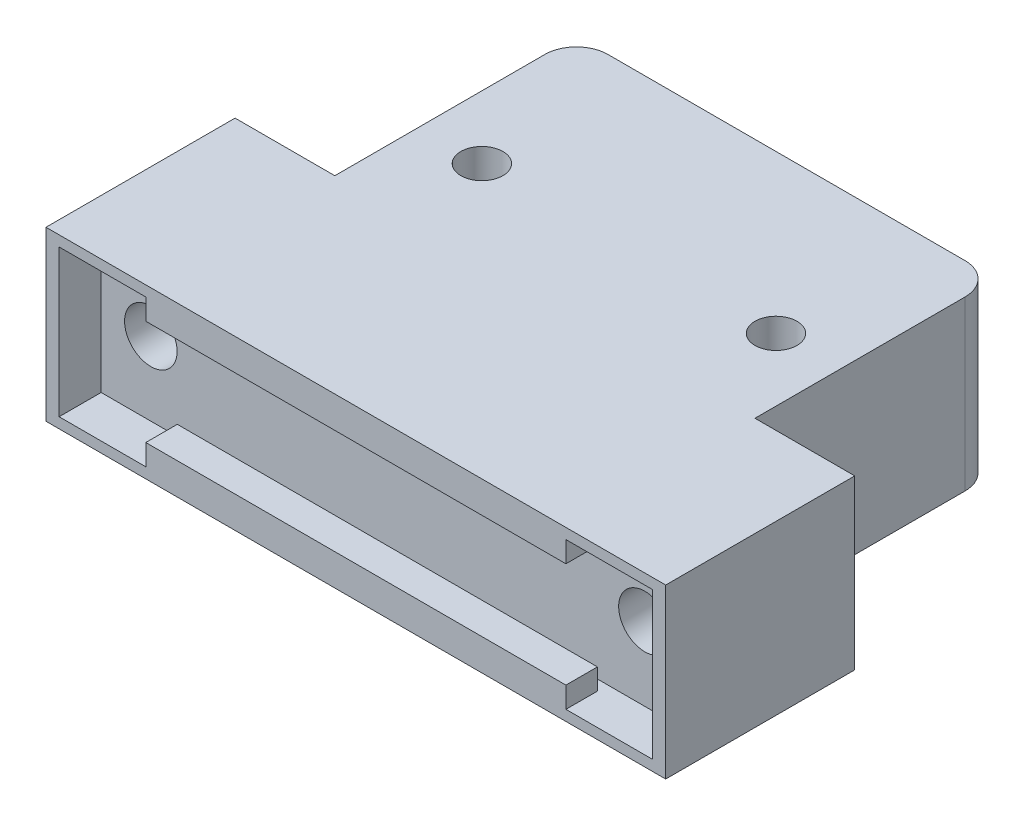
ISO-10303-21;
HEADER;
FILE_DESCRIPTION(('STEP AP214'),'2;1');
FILE_NAME('part.step','',(''),(''),'','','');
FILE_SCHEMA(('AUTOMOTIVE_DESIGN { 1 0 10303 214 1 1 1 1 }'));
ENDSEC;
DATA;
#1=APPLICATION_CONTEXT('core data for automotive mechanical design processes');
#2=APPLICATION_PROTOCOL_DEFINITION('international standard','automotive_design',2000,#1);
#3=PRODUCT_CONTEXT('',#1,'mechanical');
#4=PRODUCT('Part','Part','',(#3));
#5=PRODUCT_RELATED_PRODUCT_CATEGORY('part','',(#4));
#6=PRODUCT_DEFINITION_FORMATION('','',#4);
#7=PRODUCT_DEFINITION_CONTEXT('part definition',#1,'design');
#8=PRODUCT_DEFINITION('design','',#6,#7);
#9=PRODUCT_DEFINITION_SHAPE('','',#8);
#10=(LENGTH_UNIT() NAMED_UNIT(*) SI_UNIT(.MILLI.,.METRE.));
#11=(NAMED_UNIT(*) PLANE_ANGLE_UNIT() SI_UNIT($,.RADIAN.));
#12=(NAMED_UNIT(*) SI_UNIT($,.STERADIAN.) SOLID_ANGLE_UNIT());
#13=UNCERTAINTY_MEASURE_WITH_UNIT(LENGTH_MEASURE(1.E-05),#10,'distance_accuracy_value','');
#14=(GEOMETRIC_REPRESENTATION_CONTEXT(3) GLOBAL_UNCERTAINTY_ASSIGNED_CONTEXT((#13)) GLOBAL_UNIT_ASSIGNED_CONTEXT((#10,
#11,#12)) REPRESENTATION_CONTEXT('',''));
#15=CARTESIAN_POINT('',(0.,0.,0.));
#16=DIRECTION('',(0.,0.,1.));
#17=DIRECTION('',(1.,0.,0.));
#18=AXIS2_PLACEMENT_3D('',#15,#16,#17);
#19=CARTESIAN_POINT('',(-28.25,-7.,14.));
#20=DIRECTION('',(0.,-1.,0.));
#21=DIRECTION('',(0.,0.,-1.));
#22=AXIS2_PLACEMENT_3D('',#19,#20,#21);
#23=PLANE('',#22);
#24=DIRECTION('',(0.,0.,-1.));
#25=VECTOR('',#24,1.);
#26=CARTESIAN_POINT('',(20.,-7.,18.));
#27=LINE('',#26,#25);
#28=CARTESIAN_POINT('',(20.,-7.,18.));
#29=VERTEX_POINT('',#28);
#30=CARTESIAN_POINT('',(20.,-7.,15.));
#31=VERTEX_POINT('',#30);
#32=EDGE_CURVE('E196',#29,#31,#27,.T.);
#33=ORIENTED_EDGE('',*,*,#32,.F.);
#34=DIRECTION('',(1.,0.,0.));
#35=VECTOR('',#34,1.);
#36=CARTESIAN_POINT('',(-28.25,-7.,18.));
#37=LINE('',#36,#35);
#38=CARTESIAN_POINT('',(28.25,-7.,18.));
#39=VERTEX_POINT('',#38);
#40=EDGE_CURVE('E294',#29,#39,#37,.T.);
#41=ORIENTED_EDGE('',*,*,#40,.T.);
#42=DIRECTION('',(0.,0.,1.));
#43=VECTOR('',#42,1.);
#44=CARTESIAN_POINT('',(28.25,-7.,14.));
#45=LINE('',#44,#43);
#46=CARTESIAN_POINT('',(28.25,-7.,14.));
#47=VERTEX_POINT('',#46);
#48=EDGE_CURVE('E296',#47,#39,#45,.T.);
#49=ORIENTED_EDGE('',*,*,#48,.F.);
#50=DIRECTION('',(1.,0.,0.));
#51=VECTOR('',#50,1.);
#52=CARTESIAN_POINT('',(-28.25,-7.,14.));
#53=LINE('',#52,#51);
#54=CARTESIAN_POINT('',(-28.25,-7.,14.));
#55=VERTEX_POINT('',#54);
#56=EDGE_CURVE('E283',#55,#47,#53,.T.);
#57=ORIENTED_EDGE('',*,*,#56,.F.);
#58=DIRECTION('',(0.,0.,1.));
#59=VECTOR('',#58,1.);
#60=CARTESIAN_POINT('',(-28.25,-7.,14.));
#61=LINE('',#60,#59);
#62=CARTESIAN_POINT('',(-28.25,-7.,18.));
#63=VERTEX_POINT('',#62);
#64=EDGE_CURVE('E300',#55,#63,#61,.T.);
#65=ORIENTED_EDGE('',*,*,#64,.T.);
#66=CARTESIAN_POINT('',(-20.,-7.,18.));
#67=VERTEX_POINT('',#66);
#68=EDGE_CURVE('E277',#63,#67,#37,.T.);
#69=ORIENTED_EDGE('',*,*,#68,.T.);
#70=DIRECTION('',(0.,0.,1.));
#71=VECTOR('',#70,1.);
#72=CARTESIAN_POINT('',(-20.,-7.,18.));
#73=LINE('',#72,#71);
#74=CARTESIAN_POINT('',(-20.,-7.,15.));
#75=VERTEX_POINT('',#74);
#76=EDGE_CURVE('E235',#75,#67,#73,.T.);
#77=ORIENTED_EDGE('',*,*,#76,.F.);
#78=DIRECTION('',(-1.,0.,0.));
#79=VECTOR('',#78,1.);
#80=CARTESIAN_POINT('',(20.,-7.,15.));
#81=LINE('',#80,#79);
#82=EDGE_CURVE('E244',#31,#75,#81,.T.);
#83=ORIENTED_EDGE('',*,*,#82,.F.);
#84=EDGE_LOOP('',(#33,#41,#49,#57,#65,#69,#77,#83));
#85=FACE_BOUND('',#84,.T.);
#86=ADVANCED_FACE('F33',(#85),#23,.F.);
#87=CARTESIAN_POINT('',(-20.,8.,-23.));
#88=DIRECTION('',(1.,0.,0.));
#89=DIRECTION('',(0.,0.,-1.));
#90=AXIS2_PLACEMENT_3D('',#87,#88,#89);
#91=PLANE('',#90);
#92=DIRECTION('',(0.,0.,1.));
#93=VECTOR('',#92,1.);
#94=CARTESIAN_POINT('',(-20.,8.,-23.));
#95=LINE('',#94,#93);
#96=CARTESIAN_POINT('',(-20.,8.,-20.));
#97=VERTEX_POINT('',#96);
#98=CARTESIAN_POINT('',(-20.,8.,0.));
#99=VERTEX_POINT('',#98);
#100=EDGE_CURVE('E307',#97,#99,#95,.T.);
#101=ORIENTED_EDGE('',*,*,#100,.F.);
#102=DIRECTION('',(0.,-1.,0.));
#103=VECTOR('',#102,1.);
#104=CARTESIAN_POINT('',(-20.,8.,-20.));
#105=LINE('',#104,#103);
#106=CARTESIAN_POINT('',(-20.,-8.,-20.));
#107=VERTEX_POINT('',#106);
#108=EDGE_CURVE('E11',#97,#107,#105,.T.);
#109=ORIENTED_EDGE('',*,*,#108,.T.);
#110=DIRECTION('',(0.,0.,1.));
#111=VECTOR('',#110,1.);
#112=CARTESIAN_POINT('',(-20.,-8.,-23.));
#113=LINE('',#112,#111);
#114=CARTESIAN_POINT('',(-20.,-8.,0.));
#115=VERTEX_POINT('',#114);
#116=EDGE_CURVE('E299',#107,#115,#113,.T.);
#117=ORIENTED_EDGE('',*,*,#116,.T.);
#118=DIRECTION('',(0.,-1.,0.));
#119=VECTOR('',#118,1.);
#120=CARTESIAN_POINT('',(-20.,8.,0.));
#121=LINE('',#120,#119);
#122=EDGE_CURVE('E354',#99,#115,#121,.T.);
#123=ORIENTED_EDGE('',*,*,#122,.F.);
#124=EDGE_LOOP('',(#101,#109,#117,#123));
#125=FACE_BOUND('',#124,.T.);
#126=ADVANCED_FACE('F407',(#125),#91,.F.);
#127=CARTESIAN_POINT('',(-20.,8.,0.));
#128=DIRECTION('',(0.,0.,1.));
#129=DIRECTION('',(1.,0.,0.));
#130=AXIS2_PLACEMENT_3D('',#127,#128,#129);
#131=PLANE('',#130);
#132=CARTESIAN_POINT('',(-23.52,0.,0.));
#133=DIRECTION('',(0.,0.,1.));
#134=DIRECTION('',(1.,0.,0.));
#135=AXIS2_PLACEMENT_3D('',#132,#133,#134);
#136=CIRCLE('',#135,2.5);
#137=CARTESIAN_POINT('',(-21.02,0.,0.));
#138=VERTEX_POINT('',#137);
#139=EDGE_CURVE('E269',#138,#138,#136,.T.);
#140=ORIENTED_EDGE('',*,*,#139,.T.);
#141=EDGE_LOOP('',(#140));
#142=FACE_BOUND('',#141,.T.);
#143=DIRECTION('',(-1.,0.,0.));
#144=VECTOR('',#143,1.);
#145=CARTESIAN_POINT('',(-20.,-8.,0.));
#146=LINE('',#145,#144);
#147=CARTESIAN_POINT('',(-29.5,-8.,0.));
#148=VERTEX_POINT('',#147);
#149=EDGE_CURVE('E326',#115,#148,#146,.T.);
#150=ORIENTED_EDGE('',*,*,#149,.T.);
#151=DIRECTION('',(0.,-1.,0.));
#152=VECTOR('',#151,1.);
#153=CARTESIAN_POINT('',(-29.5,8.,0.));
#154=LINE('',#153,#152);
#155=CARTESIAN_POINT('',(-29.5,8.,0.));
#156=VERTEX_POINT('',#155);
#157=EDGE_CURVE('E351',#156,#148,#154,.T.);
#158=ORIENTED_EDGE('',*,*,#157,.F.);
#159=DIRECTION('',(-1.,0.,0.));
#160=VECTOR('',#159,1.);
#161=CARTESIAN_POINT('',(-20.,8.,0.));
#162=LINE('',#161,#160);
#163=EDGE_CURVE('E309',#99,#156,#162,.T.);
#164=ORIENTED_EDGE('',*,*,#163,.F.);
#165=ORIENTED_EDGE('',*,*,#122,.T.);
#166=EDGE_LOOP('',(#150,#158,#164,#165));
#167=FACE_BOUND('',#166,.T.);
#168=ADVANCED_FACE('F405',(#142,#167),#131,.F.);
#169=CARTESIAN_POINT('',(-29.5,8.,0.));
#170=DIRECTION('',(1.,0.,0.));
#171=DIRECTION('',(0.,0.,-1.));
#172=AXIS2_PLACEMENT_3D('',#169,#170,#171);
#173=PLANE('',#172);
#174=DIRECTION('',(0.,0.,1.));
#175=VECTOR('',#174,1.);
#176=CARTESIAN_POINT('',(-29.5,-8.,0.));
#177=LINE('',#176,#175);
#178=CARTESIAN_POINT('',(-29.5,-8.,18.));
#179=VERTEX_POINT('',#178);
#180=EDGE_CURVE('E328',#148,#179,#177,.T.);
#181=ORIENTED_EDGE('',*,*,#180,.T.);
#182=DIRECTION('',(0.,-1.,0.));
#183=VECTOR('',#182,1.);
#184=CARTESIAN_POINT('',(-29.5,8.,18.));
#185=LINE('',#184,#183);
#186=CARTESIAN_POINT('',(-29.5,8.,18.));
#187=VERTEX_POINT('',#186);
#188=EDGE_CURVE('E348',#187,#179,#185,.T.);
#189=ORIENTED_EDGE('',*,*,#188,.F.);
#190=DIRECTION('',(0.,0.,1.));
#191=VECTOR('',#190,1.);
#192=CARTESIAN_POINT('',(-29.5,8.,0.));
#193=LINE('',#192,#191);
#194=EDGE_CURVE('E312',#156,#187,#193,.T.);
#195=ORIENTED_EDGE('',*,*,#194,.F.);
#196=ORIENTED_EDGE('',*,*,#157,.T.);
#197=EDGE_LOOP('',(#181,#189,#195,#196));
#198=FACE_BOUND('',#197,.T.);
#199=ADVANCED_FACE('F398',(#198),#173,.F.);
#200=CARTESIAN_POINT('',(-29.5,8.,18.));
#201=DIRECTION('',(0.,0.,-1.));
#202=DIRECTION('',(-1.,0.,0.));
#203=AXIS2_PLACEMENT_3D('',#200,#201,#202);
#204=PLANE('',#203);
#205=DIRECTION('',(-1.,0.,0.));
#206=VECTOR('',#205,1.);
#207=CARTESIAN_POINT('',(-28.25,7.,18.));
#208=LINE('',#207,#206);
#209=CARTESIAN_POINT('',(28.25,7.,18.));
#210=VERTEX_POINT('',#209);
#211=CARTESIAN_POINT('',(20.,7.,18.));
#212=VERTEX_POINT('',#211);
#213=EDGE_CURVE('E289',#210,#212,#208,.T.);
#214=ORIENTED_EDGE('',*,*,#213,.F.);
#215=DIRECTION('',(0.,1.,0.));
#216=VECTOR('',#215,1.);
#217=CARTESIAN_POINT('',(28.25,7.,18.));
#218=LINE('',#217,#216);
#219=EDGE_CURVE('E272',#39,#210,#218,.T.);
#220=ORIENTED_EDGE('',*,*,#219,.F.);
#221=ORIENTED_EDGE('',*,*,#40,.F.);
#222=DIRECTION('',(0.,-1.,0.));
#223=VECTOR('',#222,1.);
#224=CARTESIAN_POINT('',(20.,-5.,18.));
#225=LINE('',#224,#223);
#226=CARTESIAN_POINT('',(20.,-5.,18.));
#227=VERTEX_POINT('',#226);
#228=EDGE_CURVE('E241',#227,#29,#225,.T.);
#229=ORIENTED_EDGE('',*,*,#228,.F.);
#230=DIRECTION('',(1.,0.,0.));
#231=VECTOR('',#230,1.);
#232=CARTESIAN_POINT('',(20.,-5.,18.));
#233=LINE('',#232,#231);
#234=CARTESIAN_POINT('',(-20.,-5.,18.));
#235=VERTEX_POINT('',#234);
#236=EDGE_CURVE('E239',#235,#227,#233,.T.);
#237=ORIENTED_EDGE('',*,*,#236,.F.);
#238=DIRECTION('',(0.,-1.,0.));
#239=VECTOR('',#238,1.);
#240=CARTESIAN_POINT('',(-20.,-5.,18.));
#241=LINE('',#240,#239);
#242=EDGE_CURVE('E251',#235,#67,#241,.T.);
#243=ORIENTED_EDGE('',*,*,#242,.T.);
#244=ORIENTED_EDGE('',*,*,#68,.F.);
#245=DIRECTION('',(0.,-1.,0.));
#246=VECTOR('',#245,1.);
#247=CARTESIAN_POINT('',(-28.25,7.,18.));
#248=LINE('',#247,#246);
#249=CARTESIAN_POINT('',(-28.25,7.,18.));
#250=VERTEX_POINT('',#249);
#251=EDGE_CURVE('E291',#250,#63,#248,.T.);
#252=ORIENTED_EDGE('',*,*,#251,.F.);
#253=CARTESIAN_POINT('',(-20.,7.,18.));
#254=VERTEX_POINT('',#253);
#255=EDGE_CURVE('E288',#254,#250,#208,.T.);
#256=ORIENTED_EDGE('',*,*,#255,.F.);
#257=DIRECTION('',(0.,1.,0.));
#258=VECTOR('',#257,1.);
#259=CARTESIAN_POINT('',(-20.,5.,18.));
#260=LINE('',#259,#258);
#261=CARTESIAN_POINT('',(-20.,5.,18.));
#262=VERTEX_POINT('',#261);
#263=EDGE_CURVE('E197',#262,#254,#260,.T.);
#264=ORIENTED_EDGE('',*,*,#263,.F.);
#265=DIRECTION('',(1.,0.,0.));
#266=VECTOR('',#265,1.);
#267=CARTESIAN_POINT('',(20.,5.,18.));
#268=LINE('',#267,#266);
#269=CARTESIAN_POINT('',(20.,5.,18.));
#270=VERTEX_POINT('',#269);
#271=EDGE_CURVE('E203',#262,#270,#268,.T.);
#272=ORIENTED_EDGE('',*,*,#271,.T.);
#273=DIRECTION('',(0.,1.,0.));
#274=VECTOR('',#273,1.);
#275=CARTESIAN_POINT('',(20.,5.,18.));
#276=LINE('',#275,#274);
#277=EDGE_CURVE('E185',#270,#212,#276,.T.);
#278=ORIENTED_EDGE('',*,*,#277,.T.);
#279=EDGE_LOOP('',(#214,#220,#221,#229,#237,#243,#244,#252,#256,#264,#272,#278));
#280=FACE_BOUND('',#279,.T.);
#281=DIRECTION('',(1.,0.,0.));
#282=VECTOR('',#281,1.);
#283=CARTESIAN_POINT('',(-29.5,-8.,18.));
#284=LINE('',#283,#282);
#285=CARTESIAN_POINT('',(29.5,-8.,18.));
#286=VERTEX_POINT('',#285);
#287=EDGE_CURVE('E330',#179,#286,#284,.T.);
#288=ORIENTED_EDGE('',*,*,#287,.T.);
#289=DIRECTION('',(0.,-1.,0.));
#290=VECTOR('',#289,1.);
#291=CARTESIAN_POINT('',(29.5,8.,18.));
#292=LINE('',#291,#290);
#293=CARTESIAN_POINT('',(29.5,8.,18.));
#294=VERTEX_POINT('',#293);
#295=EDGE_CURVE('E345',#294,#286,#292,.T.);
#296=ORIENTED_EDGE('',*,*,#295,.F.);
#297=DIRECTION('',(1.,0.,0.));
#298=VECTOR('',#297,1.);
#299=CARTESIAN_POINT('',(-29.5,8.,18.));
#300=LINE('',#299,#298);
#301=EDGE_CURVE('E314',#187,#294,#300,.T.);
#302=ORIENTED_EDGE('',*,*,#301,.F.);
#303=ORIENTED_EDGE('',*,*,#188,.T.);
#304=EDGE_LOOP('',(#288,#296,#302,#303));
#305=FACE_BOUND('',#304,.T.);
#306=ADVANCED_FACE('F209',(#280,#305),#204,.F.);
#307=CARTESIAN_POINT('',(29.5,8.,0.));
#308=DIRECTION('',(-1.,0.,0.));
#309=DIRECTION('',(0.,0.,1.));
#310=AXIS2_PLACEMENT_3D('',#307,#308,#309);
#311=PLANE('',#310);
#312=DIRECTION('',(0.,0.,-1.));
#313=VECTOR('',#312,1.);
#314=CARTESIAN_POINT('',(29.5,-8.,0.));
#315=LINE('',#314,#313);
#316=CARTESIAN_POINT('',(29.5,-8.,0.));
#317=VERTEX_POINT('',#316);
#318=EDGE_CURVE('E332',#286,#317,#315,.T.);
#319=ORIENTED_EDGE('',*,*,#318,.T.);
#320=DIRECTION('',(0.,-1.,0.));
#321=VECTOR('',#320,1.);
#322=CARTESIAN_POINT('',(29.5,8.,0.));
#323=LINE('',#322,#321);
#324=CARTESIAN_POINT('',(29.5,8.,0.));
#325=VERTEX_POINT('',#324);
#326=EDGE_CURVE('E342',#325,#317,#323,.T.);
#327=ORIENTED_EDGE('',*,*,#326,.F.);
#328=DIRECTION('',(0.,0.,-1.));
#329=VECTOR('',#328,1.);
#330=CARTESIAN_POINT('',(29.5,8.,0.));
#331=LINE('',#330,#329);
#332=EDGE_CURVE('E316',#294,#325,#331,.T.);
#333=ORIENTED_EDGE('',*,*,#332,.F.);
#334=ORIENTED_EDGE('',*,*,#295,.T.);
#335=EDGE_LOOP('',(#319,#327,#333,#334));
#336=FACE_BOUND('',#335,.T.);
#337=ADVANCED_FACE('F391',(#336),#311,.F.);
#338=CARTESIAN_POINT('',(20.,8.,0.));
#339=DIRECTION('',(0.,0.,1.));
#340=DIRECTION('',(1.,0.,0.));
#341=AXIS2_PLACEMENT_3D('',#338,#339,#340);
#342=PLANE('',#341);
#343=CARTESIAN_POINT('',(23.52,0.,0.));
#344=DIRECTION('',(0.,0.,1.));
#345=DIRECTION('',(1.,0.,0.));
#346=AXIS2_PLACEMENT_3D('',#343,#344,#345);
#347=CIRCLE('',#346,2.5);
#348=CARTESIAN_POINT('',(26.02,0.,0.));
#349=VERTEX_POINT('',#348);
#350=EDGE_CURVE('E263',#349,#349,#347,.F.);
#351=ORIENTED_EDGE('',*,*,#350,.F.);
#352=EDGE_LOOP('',(#351));
#353=FACE_BOUND('',#352,.T.);
#354=DIRECTION('',(-1.,0.,0.));
#355=VECTOR('',#354,1.);
#356=CARTESIAN_POINT('',(20.,-8.,0.));
#357=LINE('',#356,#355);
#358=CARTESIAN_POINT('',(20.,-8.,0.));
#359=VERTEX_POINT('',#358);
#360=EDGE_CURVE('E334',#317,#359,#357,.T.);
#361=ORIENTED_EDGE('',*,*,#360,.T.);
#362=DIRECTION('',(0.,-1.,0.));
#363=VECTOR('',#362,1.);
#364=CARTESIAN_POINT('',(20.,8.,0.));
#365=LINE('',#364,#363);
#366=CARTESIAN_POINT('',(20.,8.,0.));
#367=VERTEX_POINT('',#366);
#368=EDGE_CURVE('E324',#367,#359,#365,.T.);
#369=ORIENTED_EDGE('',*,*,#368,.F.);
#370=DIRECTION('',(-1.,0.,0.));
#371=VECTOR('',#370,1.);
#372=CARTESIAN_POINT('',(20.,8.,0.));
#373=LINE('',#372,#371);
#374=EDGE_CURVE('E318',#325,#367,#373,.T.);
#375=ORIENTED_EDGE('',*,*,#374,.F.);
#376=ORIENTED_EDGE('',*,*,#326,.T.);
#377=EDGE_LOOP('',(#361,#369,#375,#376));
#378=FACE_BOUND('',#377,.T.);
#379=ADVANCED_FACE('F385',(#353,#378),#342,.F.);
#380=CARTESIAN_POINT('',(20.,8.,-23.));
#381=DIRECTION('',(-1.,0.,0.));
#382=DIRECTION('',(0.,0.,1.));
#383=AXIS2_PLACEMENT_3D('',#380,#381,#382);
#384=PLANE('',#383);
#385=DIRECTION('',(0.,0.,-1.));
#386=VECTOR('',#385,1.);
#387=CARTESIAN_POINT('',(20.,-8.,-23.));
#388=LINE('',#387,#386);
#389=CARTESIAN_POINT('',(20.,-8.,-20.));
#390=VERTEX_POINT('',#389);
#391=EDGE_CURVE('E336',#359,#390,#388,.T.);
#392=ORIENTED_EDGE('',*,*,#391,.T.);
#393=DIRECTION('',(0.,-1.,0.));
#394=VECTOR('',#393,1.);
#395=CARTESIAN_POINT('',(20.,8.,-20.));
#396=LINE('',#395,#394);
#397=CARTESIAN_POINT('',(20.,8.,-20.));
#398=VERTEX_POINT('',#397);
#399=EDGE_CURVE('E56',#390,#398,#396,.F.);
#400=ORIENTED_EDGE('',*,*,#399,.T.);
#401=DIRECTION('',(0.,0.,-1.));
#402=VECTOR('',#401,1.);
#403=CARTESIAN_POINT('',(20.,8.,-23.));
#404=LINE('',#403,#402);
#405=EDGE_CURVE('E320',#367,#398,#404,.T.);
#406=ORIENTED_EDGE('',*,*,#405,.F.);
#407=ORIENTED_EDGE('',*,*,#368,.T.);
#408=EDGE_LOOP('',(#392,#400,#406,#407));
#409=FACE_BOUND('',#408,.T.);
#410=ADVANCED_FACE('F381',(#409),#384,.F.);
#411=CARTESIAN_POINT('',(20.,8.,-23.));
#412=DIRECTION('',(0.,0.,1.));
#413=DIRECTION('',(1.,0.,0.));
#414=AXIS2_PLACEMENT_3D('',#411,#412,#413);
#415=PLANE('',#414);
#416=DIRECTION('',(-1.,0.,0.));
#417=VECTOR('',#416,1.);
#418=CARTESIAN_POINT('',(20.,8.,-23.));
#419=LINE('',#418,#417);
#420=CARTESIAN_POINT('',(17.,8.,-23.));
#421=VERTEX_POINT('',#420);
#422=CARTESIAN_POINT('',(-17.,8.,-23.));
#423=VERTEX_POINT('',#422);
#424=EDGE_CURVE('E322',#421,#423,#419,.T.);
#425=ORIENTED_EDGE('',*,*,#424,.F.);
#426=DIRECTION('',(0.,-1.,0.));
#427=VECTOR('',#426,1.);
#428=CARTESIAN_POINT('',(17.,8.,-23.));
#429=LINE('',#428,#427);
#430=CARTESIAN_POINT('',(17.,-8.,-23.));
#431=VERTEX_POINT('',#430);
#432=EDGE_CURVE('E359',#421,#431,#429,.T.);
#433=ORIENTED_EDGE('',*,*,#432,.T.);
#434=DIRECTION('',(-1.,0.,0.));
#435=VECTOR('',#434,1.);
#436=CARTESIAN_POINT('',(20.,-8.,-23.));
#437=LINE('',#436,#435);
#438=CARTESIAN_POINT('',(-17.,-8.,-23.));
#439=VERTEX_POINT('',#438);
#440=EDGE_CURVE('E310',#431,#439,#437,.T.);
#441=ORIENTED_EDGE('',*,*,#440,.T.);
#442=DIRECTION('',(0.,-1.,0.));
#443=VECTOR('',#442,1.);
#444=CARTESIAN_POINT('',(-17.,8.,-23.));
#445=LINE('',#444,#443);
#446=EDGE_CURVE('E357',#439,#423,#445,.F.);
#447=ORIENTED_EDGE('',*,*,#446,.T.);
#448=EDGE_LOOP('',(#425,#433,#441,#447));
#449=FACE_BOUND('',#448,.T.);
#450=ADVANCED_FACE('F373',(#449),#415,.F.);
#451=CARTESIAN_POINT('',(0.,8.,0.));
#452=DIRECTION('',(0.,-1.,0.));
#453=DIRECTION('',(0.,0.,-1.));
#454=AXIS2_PLACEMENT_3D('',#451,#452,#453);
#455=PLANE('',#454);
#456=CARTESIAN_POINT('',(14.,8.,-8.));
#457=DIRECTION('',(0.,-1.,0.));
#458=DIRECTION('',(0.,0.,1.));
#459=AXIS2_PLACEMENT_3D('',#456,#457,#458);
#460=CIRCLE('',#459,2.);
#461=CARTESIAN_POINT('',(14.,8.,-6.));
#462=VERTEX_POINT('',#461);
#463=EDGE_CURVE('E521',#462,#462,#460,.T.);
#464=ORIENTED_EDGE('',*,*,#463,.T.);
#465=EDGE_LOOP('',(#464));
#466=FACE_BOUND('',#465,.T.);
#467=CARTESIAN_POINT('',(-14.,8.,-8.));
#468=DIRECTION('',(0.,1.,0.));
#469=DIRECTION('',(0.,0.,1.));
#470=AXIS2_PLACEMENT_3D('',#467,#468,#469);
#471=CIRCLE('',#470,2.);
#472=CARTESIAN_POINT('',(-14.,8.,-6.));
#473=VERTEX_POINT('',#472);
#474=EDGE_CURVE('E523',#473,#473,#471,.T.);
#475=ORIENTED_EDGE('',*,*,#474,.F.);
#476=EDGE_LOOP('',(#475));
#477=FACE_BOUND('',#476,.T.);
#478=ORIENTED_EDGE('',*,*,#405,.T.);
#479=CARTESIAN_POINT('',(17.,8.,-20.));
#480=DIRECTION('',(0.,-1.,0.));
#481=DIRECTION('',(0.,0.,-1.));
#482=AXIS2_PLACEMENT_3D('',#479,#480,#481);
#483=CIRCLE('',#482,3.);
#484=EDGE_CURVE('E41',#398,#421,#483,.F.);
#485=ORIENTED_EDGE('',*,*,#484,.T.);
#486=ORIENTED_EDGE('',*,*,#424,.T.);
#487=CARTESIAN_POINT('',(-17.,8.,-20.));
#488=DIRECTION('',(0.,-1.,0.));
#489=DIRECTION('',(0.,0.,-1.));
#490=AXIS2_PLACEMENT_3D('',#487,#488,#489);
#491=CIRCLE('',#490,3.);
#492=EDGE_CURVE('E48',#423,#97,#491,.F.);
#493=ORIENTED_EDGE('',*,*,#492,.T.);
#494=ORIENTED_EDGE('',*,*,#100,.T.);
#495=ORIENTED_EDGE('',*,*,#163,.T.);
#496=ORIENTED_EDGE('',*,*,#194,.T.);
#497=ORIENTED_EDGE('',*,*,#301,.T.);
#498=ORIENTED_EDGE('',*,*,#332,.T.);
#499=ORIENTED_EDGE('',*,*,#374,.T.);
#500=EDGE_LOOP('',(#478,#485,#486,#493,#494,#495,#496,#497,#498,#499));
#501=FACE_BOUND('',#500,.T.);
#502=ADVANCED_FACE('F369',(#466,#477,#501),#455,.F.);
#503=CARTESIAN_POINT('',(0.,-8.,0.));
#504=DIRECTION('',(0.,-1.,0.));
#505=DIRECTION('',(0.,0.,-1.));
#506=AXIS2_PLACEMENT_3D('',#503,#504,#505);
#507=PLANE('',#506);
#508=CARTESIAN_POINT('',(14.,-8.,-8.));
#509=DIRECTION('',(0.,-1.,0.));
#510=DIRECTION('',(0.,0.,1.));
#511=AXIS2_PLACEMENT_3D('',#508,#509,#510);
#512=CIRCLE('',#511,2.);
#513=CARTESIAN_POINT('',(14.,-8.,-6.));
#514=VERTEX_POINT('',#513);
#515=EDGE_CURVE('E518',#514,#514,#512,.T.);
#516=ORIENTED_EDGE('',*,*,#515,.F.);
#517=EDGE_LOOP('',(#516));
#518=FACE_BOUND('',#517,.T.);
#519=CARTESIAN_POINT('',(-14.,-8.,-8.));
#520=DIRECTION('',(0.,1.,0.));
#521=DIRECTION('',(0.,0.,1.));
#522=AXIS2_PLACEMENT_3D('',#519,#520,#521);
#523=CIRCLE('',#522,2.);
#524=CARTESIAN_POINT('',(-14.,-8.,-6.));
#525=VERTEX_POINT('',#524);
#526=EDGE_CURVE('E221',#525,#525,#523,.T.);
#527=ORIENTED_EDGE('',*,*,#526,.T.);
#528=EDGE_LOOP('',(#527));
#529=FACE_BOUND('',#528,.T.);
#530=ORIENTED_EDGE('',*,*,#440,.F.);
#531=CARTESIAN_POINT('',(17.,-8.,-20.));
#532=DIRECTION('',(0.,-1.,0.));
#533=DIRECTION('',(0.,0.,-1.));
#534=AXIS2_PLACEMENT_3D('',#531,#532,#533);
#535=CIRCLE('',#534,3.);
#536=EDGE_CURVE('E364',#431,#390,#535,.T.);
#537=ORIENTED_EDGE('',*,*,#536,.T.);
#538=ORIENTED_EDGE('',*,*,#391,.F.);
#539=ORIENTED_EDGE('',*,*,#360,.F.);
#540=ORIENTED_EDGE('',*,*,#318,.F.);
#541=ORIENTED_EDGE('',*,*,#287,.F.);
#542=ORIENTED_EDGE('',*,*,#180,.F.);
#543=ORIENTED_EDGE('',*,*,#149,.F.);
#544=ORIENTED_EDGE('',*,*,#116,.F.);
#545=CARTESIAN_POINT('',(-17.,-8.,-20.));
#546=DIRECTION('',(0.,-1.,0.));
#547=DIRECTION('',(0.,0.,-1.));
#548=AXIS2_PLACEMENT_3D('',#545,#546,#547);
#549=CIRCLE('',#548,3.);
#550=EDGE_CURVE('E362',#107,#439,#549,.T.);
#551=ORIENTED_EDGE('',*,*,#550,.T.);
#552=EDGE_LOOP('',(#530,#537,#538,#539,#540,#541,#542,#543,#544,#551));
#553=FACE_BOUND('',#552,.T.);
#554=ADVANCED_FACE('F379',(#518,#529,#553),#507,.T.);
#555=CARTESIAN_POINT('',(28.25,7.,14.));
#556=DIRECTION('',(1.,0.,0.));
#557=DIRECTION('',(0.,0.,-1.));
#558=AXIS2_PLACEMENT_3D('',#555,#556,#557);
#559=PLANE('',#558);
#560=ORIENTED_EDGE('',*,*,#219,.T.);
#561=DIRECTION('',(0.,0.,1.));
#562=VECTOR('',#561,1.);
#563=CARTESIAN_POINT('',(28.25,7.,14.));
#564=LINE('',#563,#562);
#565=CARTESIAN_POINT('',(28.25,7.,14.));
#566=VERTEX_POINT('',#565);
#567=EDGE_CURVE('E286',#566,#210,#564,.T.);
#568=ORIENTED_EDGE('',*,*,#567,.F.);
#569=DIRECTION('',(0.,1.,0.));
#570=VECTOR('',#569,1.);
#571=CARTESIAN_POINT('',(28.25,7.,14.));
#572=LINE('',#571,#570);
#573=EDGE_CURVE('E273',#47,#566,#572,.T.);
#574=ORIENTED_EDGE('',*,*,#573,.F.);
#575=ORIENTED_EDGE('',*,*,#48,.T.);
#576=EDGE_LOOP('',(#560,#568,#574,#575));
#577=FACE_BOUND('',#576,.T.);
#578=ADVANCED_FACE('F437',(#577),#559,.F.);
#579=CARTESIAN_POINT('',(-28.25,7.,14.));
#580=DIRECTION('',(-1.,0.,0.));
#581=DIRECTION('',(0.,0.,1.));
#582=AXIS2_PLACEMENT_3D('',#579,#580,#581);
#583=PLANE('',#582);
#584=ORIENTED_EDGE('',*,*,#251,.T.);
#585=ORIENTED_EDGE('',*,*,#64,.F.);
#586=DIRECTION('',(0.,-1.,0.));
#587=VECTOR('',#586,1.);
#588=CARTESIAN_POINT('',(-28.25,7.,14.));
#589=LINE('',#588,#587);
#590=CARTESIAN_POINT('',(-28.25,7.,14.));
#591=VERTEX_POINT('',#590);
#592=EDGE_CURVE('E280',#591,#55,#589,.T.);
#593=ORIENTED_EDGE('',*,*,#592,.F.);
#594=DIRECTION('',(0.,0.,1.));
#595=VECTOR('',#594,1.);
#596=CARTESIAN_POINT('',(-28.25,7.,14.));
#597=LINE('',#596,#595);
#598=EDGE_CURVE('E302',#591,#250,#597,.T.);
#599=ORIENTED_EDGE('',*,*,#598,.T.);
#600=EDGE_LOOP('',(#584,#585,#593,#599));
#601=FACE_BOUND('',#600,.T.);
#602=ADVANCED_FACE('F433',(#601),#583,.F.);
#603=CARTESIAN_POINT('',(-28.25,7.,14.));
#604=DIRECTION('',(0.,1.,0.));
#605=DIRECTION('',(0.,0.,1.));
#606=AXIS2_PLACEMENT_3D('',#603,#604,#605);
#607=PLANE('',#606);
#608=ORIENTED_EDGE('',*,*,#213,.T.);
#609=DIRECTION('',(0.,0.,-1.));
#610=VECTOR('',#609,1.);
#611=CARTESIAN_POINT('',(20.,7.,18.));
#612=LINE('',#611,#610);
#613=CARTESIAN_POINT('',(20.,7.,15.));
#614=VERTEX_POINT('',#613);
#615=EDGE_CURVE('E191',#212,#614,#612,.T.);
#616=ORIENTED_EDGE('',*,*,#615,.T.);
#617=DIRECTION('',(-1.,0.,0.));
#618=VECTOR('',#617,1.);
#619=CARTESIAN_POINT('',(20.,7.,15.));
#620=LINE('',#619,#618);
#621=CARTESIAN_POINT('',(-20.,7.,15.));
#622=VERTEX_POINT('',#621);
#623=EDGE_CURVE('E207',#614,#622,#620,.T.);
#624=ORIENTED_EDGE('',*,*,#623,.T.);
#625=DIRECTION('',(0.,0.,1.));
#626=VECTOR('',#625,1.);
#627=CARTESIAN_POINT('',(-20.,7.,18.));
#628=LINE('',#627,#626);
#629=EDGE_CURVE('E220',#622,#254,#628,.T.);
#630=ORIENTED_EDGE('',*,*,#629,.T.);
#631=ORIENTED_EDGE('',*,*,#255,.T.);
#632=ORIENTED_EDGE('',*,*,#598,.F.);
#633=DIRECTION('',(-1.,0.,0.));
#634=VECTOR('',#633,1.);
#635=CARTESIAN_POINT('',(-28.25,7.,14.));
#636=LINE('',#635,#634);
#637=EDGE_CURVE('E276',#566,#591,#636,.T.);
#638=ORIENTED_EDGE('',*,*,#637,.F.);
#639=ORIENTED_EDGE('',*,*,#567,.T.);
#640=EDGE_LOOP('',(#608,#616,#624,#630,#631,#632,#638,#639));
#641=FACE_BOUND('',#640,.T.);
#642=ADVANCED_FACE('F436',(#641),#607,.F.);
#643=CARTESIAN_POINT('',(0.,0.,14.));
#644=DIRECTION('',(0.,0.,1.));
#645=DIRECTION('',(1.,0.,0.));
#646=AXIS2_PLACEMENT_3D('',#643,#644,#645);
#647=PLANE('',#646);
#648=CARTESIAN_POINT('',(23.52,0.,14.));
#649=DIRECTION('',(0.,0.,-1.));
#650=DIRECTION('',(-1.,0.,0.));
#651=AXIS2_PLACEMENT_3D('',#648,#649,#650);
#652=CIRCLE('',#651,2.5);
#653=CARTESIAN_POINT('',(21.02,0.,14.));
#654=VERTEX_POINT('',#653);
#655=EDGE_CURVE('E260',#654,#654,#652,.T.);
#656=ORIENTED_EDGE('',*,*,#655,.T.);
#657=EDGE_LOOP('',(#656));
#658=FACE_BOUND('',#657,.T.);
#659=CARTESIAN_POINT('',(-23.52,0.,14.));
#660=DIRECTION('',(0.,0.,1.));
#661=DIRECTION('',(1.,0.,0.));
#662=AXIS2_PLACEMENT_3D('',#659,#660,#661);
#663=CIRCLE('',#662,2.5);
#664=CARTESIAN_POINT('',(-21.02,0.,14.));
#665=VERTEX_POINT('',#664);
#666=EDGE_CURVE('E266',#665,#665,#663,.T.);
#667=ORIENTED_EDGE('',*,*,#666,.F.);
#668=EDGE_LOOP('',(#667));
#669=FACE_BOUND('',#668,.T.);
#670=ORIENTED_EDGE('',*,*,#573,.T.);
#671=ORIENTED_EDGE('',*,*,#637,.T.);
#672=ORIENTED_EDGE('',*,*,#592,.T.);
#673=ORIENTED_EDGE('',*,*,#56,.T.);
#674=EDGE_LOOP('',(#670,#671,#672,#673));
#675=FACE_BOUND('',#674,.T.);
#676=ADVANCED_FACE('F431',(#658,#669,#675),#647,.T.);
#677=CARTESIAN_POINT('',(-23.52,0.,-23.));
#678=DIRECTION('',(0.,0.,1.));
#679=DIRECTION('',(1.,0.,0.));
#680=AXIS2_PLACEMENT_3D('',#677,#678,#679);
#681=CYLINDRICAL_SURFACE('',#680,2.5);
#682=ORIENTED_EDGE('',*,*,#666,.T.);
#683=EDGE_LOOP('',(#682));
#684=FACE_BOUND('',#683,.T.);
#685=ORIENTED_EDGE('',*,*,#139,.F.);
#686=EDGE_LOOP('',(#685));
#687=FACE_BOUND('',#686,.T.);
#688=ADVANCED_FACE('F471',(#684,#687),#681,.F.);
#689=CARTESIAN_POINT('',(23.52,0.,-23.));
#690=DIRECTION('',(0.,0.,1.));
#691=DIRECTION('',(1.,0.,0.));
#692=AXIS2_PLACEMENT_3D('',#689,#690,#691);
#693=CYLINDRICAL_SURFACE('',#692,2.5);
#694=ORIENTED_EDGE('',*,*,#655,.F.);
#695=EDGE_LOOP('',(#694));
#696=FACE_BOUND('',#695,.T.);
#697=ORIENTED_EDGE('',*,*,#350,.T.);
#698=EDGE_LOOP('',(#697));
#699=FACE_BOUND('',#698,.T.);
#700=ADVANCED_FACE('F473',(#696,#699),#693,.F.);
#701=CARTESIAN_POINT('',(20.,-5.,18.));
#702=DIRECTION('',(-1.,0.,0.));
#703=DIRECTION('',(0.,0.,1.));
#704=AXIS2_PLACEMENT_3D('',#701,#702,#703);
#705=PLANE('',#704);
#706=ORIENTED_EDGE('',*,*,#32,.T.);
#707=DIRECTION('',(0.,-1.,0.));
#708=VECTOR('',#707,1.);
#709=CARTESIAN_POINT('',(20.,-5.,15.));
#710=LINE('',#709,#708);
#711=CARTESIAN_POINT('',(20.,-5.,15.));
#712=VERTEX_POINT('',#711);
#713=EDGE_CURVE('E257',#712,#31,#710,.T.);
#714=ORIENTED_EDGE('',*,*,#713,.F.);
#715=DIRECTION('',(0.,0.,-1.));
#716=VECTOR('',#715,1.);
#717=CARTESIAN_POINT('',(20.,-5.,18.));
#718=LINE('',#717,#716);
#719=EDGE_CURVE('E231',#227,#712,#718,.T.);
#720=ORIENTED_EDGE('',*,*,#719,.F.);
#721=ORIENTED_EDGE('',*,*,#228,.T.);
#722=EDGE_LOOP('',(#706,#714,#720,#721));
#723=FACE_BOUND('',#722,.T.);
#724=ADVANCED_FACE('F479',(#723),#705,.F.);
#725=CARTESIAN_POINT('',(20.,-5.,15.));
#726=DIRECTION('',(0.,0.,1.));
#727=DIRECTION('',(1.,0.,0.));
#728=AXIS2_PLACEMENT_3D('',#725,#726,#727);
#729=PLANE('',#728);
#730=ORIENTED_EDGE('',*,*,#82,.T.);
#731=DIRECTION('',(0.,-1.,0.));
#732=VECTOR('',#731,1.);
#733=CARTESIAN_POINT('',(-20.,-5.,15.));
#734=LINE('',#733,#732);
#735=CARTESIAN_POINT('',(-20.,-5.,15.));
#736=VERTEX_POINT('',#735);
#737=EDGE_CURVE('E254',#736,#75,#734,.T.);
#738=ORIENTED_EDGE('',*,*,#737,.F.);
#739=DIRECTION('',(-1.,0.,0.));
#740=VECTOR('',#739,1.);
#741=CARTESIAN_POINT('',(20.,-5.,15.));
#742=LINE('',#741,#740);
#743=EDGE_CURVE('E234',#712,#736,#742,.T.);
#744=ORIENTED_EDGE('',*,*,#743,.F.);
#745=ORIENTED_EDGE('',*,*,#713,.T.);
#746=EDGE_LOOP('',(#730,#738,#744,#745));
#747=FACE_BOUND('',#746,.T.);
#748=ADVANCED_FACE('F486',(#747),#729,.F.);
#749=CARTESIAN_POINT('',(-20.,-5.,18.));
#750=DIRECTION('',(1.,0.,0.));
#751=DIRECTION('',(0.,0.,-1.));
#752=AXIS2_PLACEMENT_3D('',#749,#750,#751);
#753=PLANE('',#752);
#754=ORIENTED_EDGE('',*,*,#76,.T.);
#755=ORIENTED_EDGE('',*,*,#242,.F.);
#756=DIRECTION('',(0.,0.,1.));
#757=VECTOR('',#756,1.);
#758=CARTESIAN_POINT('',(-20.,-5.,18.));
#759=LINE('',#758,#757);
#760=EDGE_CURVE('E237',#736,#235,#759,.T.);
#761=ORIENTED_EDGE('',*,*,#760,.F.);
#762=ORIENTED_EDGE('',*,*,#737,.T.);
#763=EDGE_LOOP('',(#754,#755,#761,#762));
#764=FACE_BOUND('',#763,.T.);
#765=ADVANCED_FACE('F490',(#764),#753,.F.);
#766=CARTESIAN_POINT('',(0.,-5.,0.));
#767=DIRECTION('',(0.,1.,0.));
#768=DIRECTION('',(0.,0.,1.));
#769=AXIS2_PLACEMENT_3D('',#766,#767,#768);
#770=PLANE('',#769);
#771=ORIENTED_EDGE('',*,*,#719,.T.);
#772=ORIENTED_EDGE('',*,*,#743,.T.);
#773=ORIENTED_EDGE('',*,*,#760,.T.);
#774=ORIENTED_EDGE('',*,*,#236,.T.);
#775=EDGE_LOOP('',(#771,#772,#773,#774));
#776=FACE_BOUND('',#775,.T.);
#777=ADVANCED_FACE('F494',(#776),#770,.T.);
#778=CARTESIAN_POINT('',(20.,5.,18.));
#779=DIRECTION('',(1.,0.,0.));
#780=DIRECTION('',(0.,0.,-1.));
#781=AXIS2_PLACEMENT_3D('',#778,#779,#780);
#782=PLANE('',#781);
#783=ORIENTED_EDGE('',*,*,#615,.F.);
#784=ORIENTED_EDGE('',*,*,#277,.F.);
#785=DIRECTION('',(0.,0.,-1.));
#786=VECTOR('',#785,1.);
#787=CARTESIAN_POINT('',(20.,5.,18.));
#788=LINE('',#787,#786);
#789=CARTESIAN_POINT('',(20.,5.,15.));
#790=VERTEX_POINT('',#789);
#791=EDGE_CURVE('E188',#270,#790,#788,.T.);
#792=ORIENTED_EDGE('',*,*,#791,.T.);
#793=DIRECTION('',(0.,1.,0.));
#794=VECTOR('',#793,1.);
#795=CARTESIAN_POINT('',(20.,5.,15.));
#796=LINE('',#795,#794);
#797=EDGE_CURVE('E218',#790,#614,#796,.T.);
#798=ORIENTED_EDGE('',*,*,#797,.T.);
#799=EDGE_LOOP('',(#783,#784,#792,#798));
#800=FACE_BOUND('',#799,.T.);
#801=ADVANCED_FACE('F187',(#800),#782,.T.);
#802=CARTESIAN_POINT('',(-20.,5.,18.));
#803=DIRECTION('',(-1.,0.,0.));
#804=DIRECTION('',(0.,0.,1.));
#805=AXIS2_PLACEMENT_3D('',#802,#803,#804);
#806=PLANE('',#805);
#807=ORIENTED_EDGE('',*,*,#629,.F.);
#808=DIRECTION('',(0.,1.,0.));
#809=VECTOR('',#808,1.);
#810=CARTESIAN_POINT('',(-20.,5.,15.));
#811=LINE('',#810,#809);
#812=CARTESIAN_POINT('',(-20.,5.,15.));
#813=VERTEX_POINT('',#812);
#814=EDGE_CURVE('E227',#813,#622,#811,.T.);
#815=ORIENTED_EDGE('',*,*,#814,.F.);
#816=DIRECTION('',(0.,0.,1.));
#817=VECTOR('',#816,1.);
#818=CARTESIAN_POINT('',(-20.,5.,18.));
#819=LINE('',#818,#817);
#820=EDGE_CURVE('E212',#813,#262,#819,.T.);
#821=ORIENTED_EDGE('',*,*,#820,.T.);
#822=ORIENTED_EDGE('',*,*,#263,.T.);
#823=EDGE_LOOP('',(#807,#815,#821,#822));
#824=FACE_BOUND('',#823,.T.);
#825=ADVANCED_FACE('F501',(#824),#806,.T.);
#826=CARTESIAN_POINT('',(20.,5.,15.));
#827=DIRECTION('',(0.,0.,-1.));
#828=DIRECTION('',(-1.,0.,0.));
#829=AXIS2_PLACEMENT_3D('',#826,#827,#828);
#830=PLANE('',#829);
#831=ORIENTED_EDGE('',*,*,#623,.F.);
#832=ORIENTED_EDGE('',*,*,#797,.F.);
#833=DIRECTION('',(-1.,0.,0.));
#834=VECTOR('',#833,1.);
#835=CARTESIAN_POINT('',(20.,5.,15.));
#836=LINE('',#835,#834);
#837=EDGE_CURVE('E206',#790,#813,#836,.T.);
#838=ORIENTED_EDGE('',*,*,#837,.T.);
#839=ORIENTED_EDGE('',*,*,#814,.T.);
#840=EDGE_LOOP('',(#831,#832,#838,#839));
#841=FACE_BOUND('',#840,.T.);
#842=ADVANCED_FACE('F504',(#841),#830,.T.);
#843=CARTESIAN_POINT('',(0.,5.,0.));
#844=DIRECTION('',(0.,-1.,0.));
#845=DIRECTION('',(0.,0.,1.));
#846=AXIS2_PLACEMENT_3D('',#843,#844,#845);
#847=PLANE('',#846);
#848=ORIENTED_EDGE('',*,*,#791,.F.);
#849=ORIENTED_EDGE('',*,*,#271,.F.);
#850=ORIENTED_EDGE('',*,*,#820,.F.);
#851=ORIENTED_EDGE('',*,*,#837,.F.);
#852=EDGE_LOOP('',(#848,#849,#850,#851));
#853=FACE_BOUND('',#852,.T.);
#854=ADVANCED_FACE('F201',(#853),#847,.T.);
#855=CARTESIAN_POINT('',(17.,8.,-20.));
#856=DIRECTION('',(0.,-1.,0.));
#857=DIRECTION('',(0.,0.,-1.));
#858=AXIS2_PLACEMENT_3D('',#855,#856,#857);
#859=CYLINDRICAL_SURFACE('',#858,3.);
#860=ORIENTED_EDGE('',*,*,#484,.F.);
#861=ORIENTED_EDGE('',*,*,#399,.F.);
#862=ORIENTED_EDGE('',*,*,#536,.F.);
#863=ORIENTED_EDGE('',*,*,#432,.F.);
#864=EDGE_LOOP('',(#860,#861,#862,#863));
#865=FACE_BOUND('',#864,.T.);
#866=ADVANCED_FACE('F376',(#865),#859,.T.);
#867=CARTESIAN_POINT('',(-17.,8.,-20.));
#868=DIRECTION('',(0.,-1.,0.));
#869=DIRECTION('',(0.,0.,-1.));
#870=AXIS2_PLACEMENT_3D('',#867,#868,#869);
#871=CYLINDRICAL_SURFACE('',#870,3.);
#872=ORIENTED_EDGE('',*,*,#492,.F.);
#873=ORIENTED_EDGE('',*,*,#446,.F.);
#874=ORIENTED_EDGE('',*,*,#550,.F.);
#875=ORIENTED_EDGE('',*,*,#108,.F.);
#876=EDGE_LOOP('',(#872,#873,#874,#875));
#877=FACE_BOUND('',#876,.T.);
#878=ADVANCED_FACE('F35',(#877),#871,.T.);
#879=CARTESIAN_POINT('',(-14.,-8.,-8.));
#880=DIRECTION('',(0.,1.,0.));
#881=DIRECTION('',(0.,0.,1.));
#882=AXIS2_PLACEMENT_3D('',#879,#880,#881);
#883=CYLINDRICAL_SURFACE('',#882,2.);
#884=ORIENTED_EDGE('',*,*,#526,.F.);
#885=EDGE_LOOP('',(#884));
#886=FACE_BOUND('',#885,.T.);
#887=ORIENTED_EDGE('',*,*,#474,.T.);
#888=EDGE_LOOP('',(#887));
#889=FACE_BOUND('',#888,.T.);
#890=ADVANCED_FACE('F411',(#886,#889),#883,.F.);
#891=CARTESIAN_POINT('',(14.,-8.,-8.));
#892=DIRECTION('',(0.,1.,0.));
#893=DIRECTION('',(0.,0.,1.));
#894=AXIS2_PLACEMENT_3D('',#891,#892,#893);
#895=CYLINDRICAL_SURFACE('',#894,2.);
#896=ORIENTED_EDGE('',*,*,#515,.T.);
#897=EDGE_LOOP('',(#896));
#898=FACE_BOUND('',#897,.T.);
#899=ORIENTED_EDGE('',*,*,#463,.F.);
#900=EDGE_LOOP('',(#899));
#901=FACE_BOUND('',#900,.T.);
#902=ADVANCED_FACE('F416',(#898,#901),#895,.F.);
#903=CLOSED_SHELL('',(#86,#126,#168,#199,#306,#337,#379,#410,#450,#502,#554,#578,#602,#642,#676,
#688,#700,#724,#748,#765,#777,#801,#825,#842,#854,#866,#878,#890,#902));
#904=MANIFOLD_SOLID_BREP('B2',#903);
#905=ADVANCED_BREP_SHAPE_REPRESENTATION('',(#18,#904),#14);
#906=SHAPE_DEFINITION_REPRESENTATION(#9,#905);
ENDSEC;
END-ISO-10303-21;
